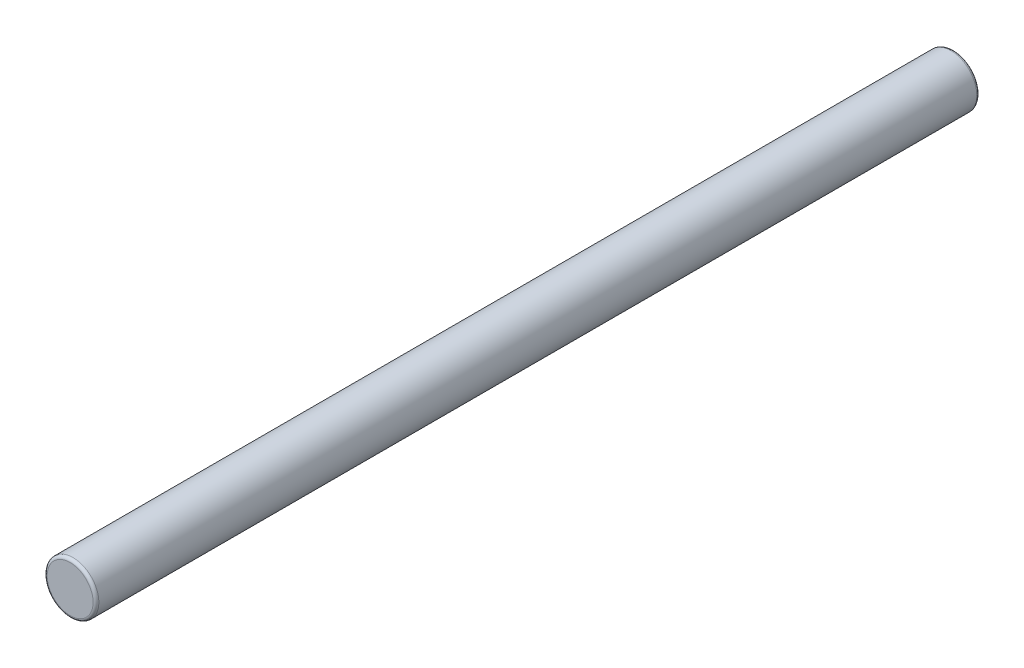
ISO-10303-21;
HEADER;
FILE_DESCRIPTION(('STEP AP214'),'2;1');
FILE_NAME('part.step','',(''),(''),'','','');
FILE_SCHEMA(('AUTOMOTIVE_DESIGN { 1 0 10303 214 1 1 1 1 }'));
ENDSEC;
DATA;
#1=APPLICATION_CONTEXT('core data for automotive mechanical design processes');
#2=APPLICATION_PROTOCOL_DEFINITION('international standard','automotive_design',2000,#1);
#3=PRODUCT_CONTEXT('',#1,'mechanical');
#4=PRODUCT('Part','Part','',(#3));
#5=PRODUCT_RELATED_PRODUCT_CATEGORY('part','',(#4));
#6=PRODUCT_DEFINITION_FORMATION('','',#4);
#7=PRODUCT_DEFINITION_CONTEXT('part definition',#1,'design');
#8=PRODUCT_DEFINITION('design','',#6,#7);
#9=PRODUCT_DEFINITION_SHAPE('','',#8);
#10=(LENGTH_UNIT() NAMED_UNIT(*) SI_UNIT(.MILLI.,.METRE.));
#11=(NAMED_UNIT(*) PLANE_ANGLE_UNIT() SI_UNIT($,.RADIAN.));
#12=(NAMED_UNIT(*) SI_UNIT($,.STERADIAN.) SOLID_ANGLE_UNIT());
#13=UNCERTAINTY_MEASURE_WITH_UNIT(LENGTH_MEASURE(1.E-05),#10,'distance_accuracy_value','');
#14=(GEOMETRIC_REPRESENTATION_CONTEXT(3) GLOBAL_UNCERTAINTY_ASSIGNED_CONTEXT((#13)) GLOBAL_UNIT_ASSIGNED_CONTEXT((#10,
#11,#12)) REPRESENTATION_CONTEXT('',''));
#15=CARTESIAN_POINT('',(0.,0.,0.));
#16=DIRECTION('',(0.,0.,1.));
#17=DIRECTION('',(1.,0.,0.));
#18=AXIS2_PLACEMENT_3D('',#15,#16,#17);
#19=CARTESIAN_POINT('',(0.,0.,0.));
#20=DIRECTION('',(0.,0.,1.));
#21=DIRECTION('',(1.,0.,0.));
#22=AXIS2_PLACEMENT_3D('',#19,#20,#21);
#23=PLANE('',#22);
#24=CARTESIAN_POINT('',(0.,0.,0.));
#25=DIRECTION('',(0.,0.,1.));
#26=DIRECTION('',(1.,0.,0.));
#27=AXIS2_PLACEMENT_3D('',#24,#25,#26);
#28=CIRCLE('',#27,16.);
#29=CARTESIAN_POINT('',(16.,0.,0.));
#30=VERTEX_POINT('',#29);
#31=EDGE_CURVE('E48',#30,#30,#28,.T.);
#32=ORIENTED_EDGE('',*,*,#31,.T.);
#33=EDGE_LOOP('',(#32));
#34=FACE_BOUND('',#33,.T.);
#35=ADVANCED_FACE('F33',(#34),#23,.T.);
#36=CARTESIAN_POINT('',(0.,0.,-615.));
#37=DIRECTION('',(0.,0.,1.));
#38=DIRECTION('',(1.,0.,0.));
#39=AXIS2_PLACEMENT_3D('',#36,#37,#38);
#40=PLANE('',#39);
#41=CARTESIAN_POINT('',(0.,0.,-615.));
#42=DIRECTION('',(0.,0.,1.));
#43=DIRECTION('',(1.,0.,0.));
#44=AXIS2_PLACEMENT_3D('',#41,#42,#43);
#45=CIRCLE('',#44,16.);
#46=CARTESIAN_POINT('',(16.,0.,-615.));
#47=VERTEX_POINT('',#46);
#48=EDGE_CURVE('E10',#47,#47,#45,.F.);
#49=ORIENTED_EDGE('',*,*,#48,.T.);
#50=EDGE_LOOP('',(#49));
#51=FACE_BOUND('',#50,.T.);
#52=ADVANCED_FACE('F64',(#51),#40,.F.);
#53=CARTESIAN_POINT('',(0.,0.,0.));
#54=DIRECTION('',(0.,0.,-1.));
#55=DIRECTION('',(-1.,0.,0.));
#56=AXIS2_PLACEMENT_3D('',#53,#54,#55);
#57=CYLINDRICAL_SURFACE('',#56,18.);
#58=CARTESIAN_POINT('',(0.,0.,-2.));
#59=DIRECTION('',(0.,0.,1.));
#60=DIRECTION('',(1.,0.,0.));
#61=AXIS2_PLACEMENT_3D('',#58,#59,#60);
#62=CIRCLE('',#61,18.);
#63=CARTESIAN_POINT('',(18.,0.,-2.));
#64=VERTEX_POINT('',#63);
#65=EDGE_CURVE('E40',#64,#64,#62,.F.);
#66=ORIENTED_EDGE('',*,*,#65,.T.);
#67=EDGE_LOOP('',(#66));
#68=FACE_BOUND('',#67,.T.);
#69=CARTESIAN_POINT('',(0.,0.,-613.));
#70=DIRECTION('',(0.,0.,1.));
#71=DIRECTION('',(1.,0.,0.));
#72=AXIS2_PLACEMENT_3D('',#69,#70,#71);
#73=CIRCLE('',#72,18.);
#74=CARTESIAN_POINT('',(18.,0.,-613.));
#75=VERTEX_POINT('',#74);
#76=EDGE_CURVE('E44',#75,#75,#73,.T.);
#77=ORIENTED_EDGE('',*,*,#76,.T.);
#78=EDGE_LOOP('',(#77));
#79=FACE_BOUND('',#78,.T.);
#80=ADVANCED_FACE('F57',(#68,#79),#57,.T.);
#81=CARTESIAN_POINT('',(0.,0.,-2.));
#82=DIRECTION('',(0.,0.,1.));
#83=DIRECTION('',(1.,0.,0.));
#84=AXIS2_PLACEMENT_3D('',#81,#82,#83);
#85=TOROIDAL_SURFACE('',#84,16.,2.);
#86=ORIENTED_EDGE('',*,*,#65,.F.);
#87=EDGE_LOOP('',(#86));
#88=FACE_BOUND('',#87,.T.);
#89=ORIENTED_EDGE('',*,*,#31,.F.);
#90=EDGE_LOOP('',(#89));
#91=FACE_BOUND('',#90,.T.);
#92=ADVANCED_FACE('F55',(#88,#91),#85,.T.);
#93=CARTESIAN_POINT('',(0.,0.,-613.));
#94=DIRECTION('',(0.,0.,1.));
#95=DIRECTION('',(1.,0.,0.));
#96=AXIS2_PLACEMENT_3D('',#93,#94,#95);
#97=TOROIDAL_SURFACE('',#96,16.,2.);
#98=ORIENTED_EDGE('',*,*,#48,.F.);
#99=EDGE_LOOP('',(#98));
#100=FACE_BOUND('',#99,.T.);
#101=ORIENTED_EDGE('',*,*,#76,.F.);
#102=EDGE_LOOP('',(#101));
#103=FACE_BOUND('',#102,.T.);
#104=ADVANCED_FACE('F35',(#100,#103),#97,.T.);
#105=CLOSED_SHELL('',(#35,#52,#80,#92,#104));
#106=MANIFOLD_SOLID_BREP('B2',#105);
#107=ADVANCED_BREP_SHAPE_REPRESENTATION('',(#18,#106),#14);
#108=SHAPE_DEFINITION_REPRESENTATION(#9,#107);
ENDSEC;
END-ISO-10303-21;
